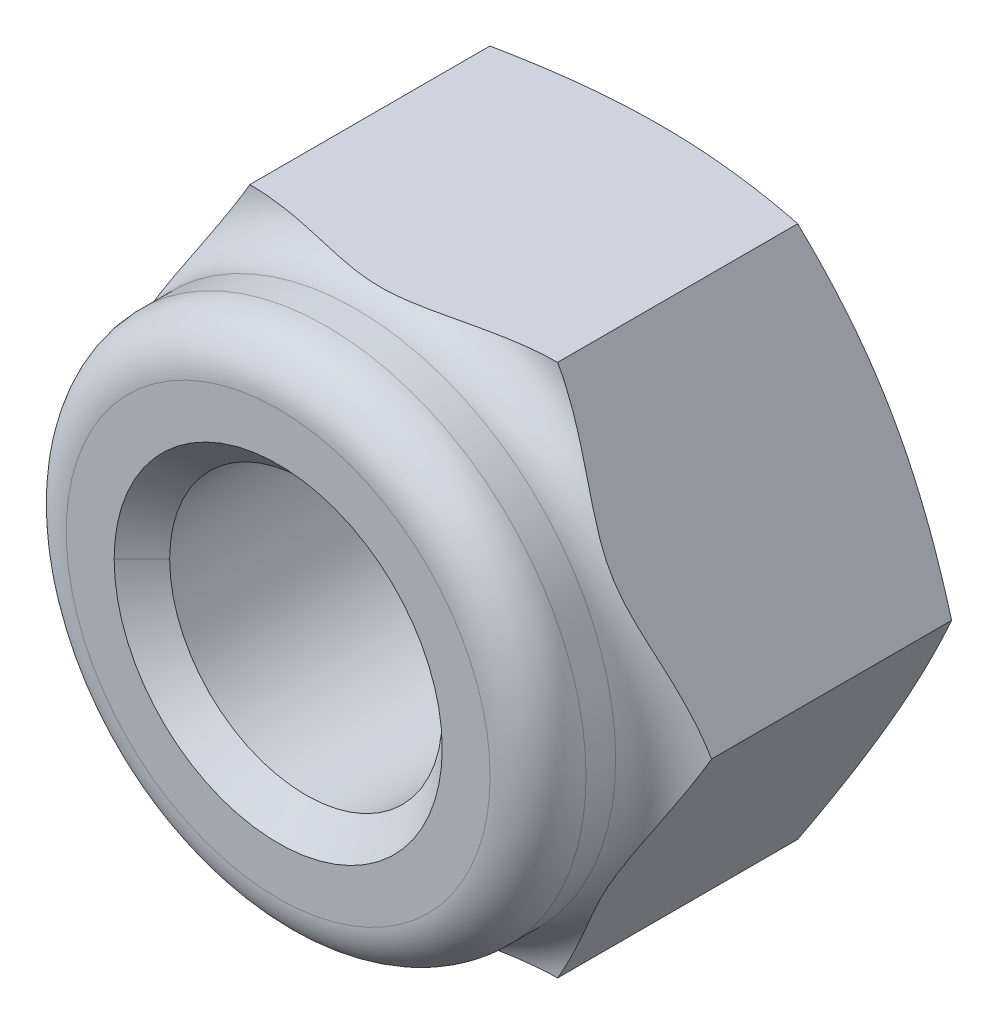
ISO-10303-21;
HEADER;
FILE_DESCRIPTION(('STEP AP214'),'2;1');
FILE_NAME('part.step','',(''),(''),'','','');
FILE_SCHEMA(('AUTOMOTIVE_DESIGN { 1 0 10303 214 1 1 1 1 }'));
ENDSEC;
DATA;
#1=APPLICATION_CONTEXT('core data for automotive mechanical design processes');
#2=APPLICATION_PROTOCOL_DEFINITION('international standard','automotive_design',2000,#1);
#3=PRODUCT_CONTEXT('',#1,'mechanical');
#4=PRODUCT('Part','Part','',(#3));
#5=PRODUCT_RELATED_PRODUCT_CATEGORY('part','',(#4));
#6=PRODUCT_DEFINITION_FORMATION('','',#4);
#7=PRODUCT_DEFINITION_CONTEXT('part definition',#1,'design');
#8=PRODUCT_DEFINITION('design','',#6,#7);
#9=PRODUCT_DEFINITION_SHAPE('','',#8);
#10=(LENGTH_UNIT() NAMED_UNIT(*) SI_UNIT(.MILLI.,.METRE.));
#11=(NAMED_UNIT(*) PLANE_ANGLE_UNIT() SI_UNIT($,.RADIAN.));
#12=(NAMED_UNIT(*) SI_UNIT($,.STERADIAN.) SOLID_ANGLE_UNIT());
#13=UNCERTAINTY_MEASURE_WITH_UNIT(LENGTH_MEASURE(1.E-05),#10,'distance_accuracy_value','');
#14=(GEOMETRIC_REPRESENTATION_CONTEXT(3) GLOBAL_UNCERTAINTY_ASSIGNED_CONTEXT((#13)) GLOBAL_UNIT_ASSIGNED_CONTEXT((#10,
#11,#12)) REPRESENTATION_CONTEXT('',''));
#15=CARTESIAN_POINT('',(0.,0.,0.));
#16=DIRECTION('',(0.,0.,1.));
#17=DIRECTION('',(1.,0.,0.));
#18=AXIS2_PLACEMENT_3D('',#15,#16,#17);
#19=CARTESIAN_POINT('',(0.,0.,7.60851666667));
#20=DIRECTION('',(0.,0.,1.));
#21=DIRECTION('',(0.,-1.,0.));
#22=AXIS2_PLACEMENT_3D('',#19,#20,#21);
#23=TOROIDAL_SURFACE('',#22,7.50555,1.16851666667);
#24=CARTESIAN_POINT('',(0.,0.,7.60851666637));
#25=DIRECTION('',(0.,0.,1.));
#26=DIRECTION('',(0.,-1.,0.));
#27=AXIS2_PLACEMENT_3D('',#24,#25,#26);
#28=CIRCLE('',#27,6.33703333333);
#29=CARTESIAN_POINT('',(0.,-6.33703333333,7.60851666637));
#30=VERTEX_POINT('',#29);
#31=EDGE_CURVE('E110',#30,#30,#28,.T.);
#32=ORIENTED_EDGE('',*,*,#31,.F.);
#33=EDGE_LOOP('',(#32));
#34=FACE_BOUND('',#33,.T.);
#35=CARTESIAN_POINT('',(-3.75277496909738,-6.4999970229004,6.44));
#36=CARTESIAN_POINT('',(-3.79393598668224,-6.42870404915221,6.44001193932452));
#37=CARTESIAN_POINT('',(-3.83508282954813,-6.35743562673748,6.44217394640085));
#38=CARTESIAN_POINT('',(-3.91726140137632,-6.2150981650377,6.45024483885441));
#39=CARTESIAN_POINT('',(-3.9582931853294,-6.14402903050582,6.45615143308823));
#40=CARTESIAN_POINT('',(-4.03989187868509,-6.00269594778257,6.47110217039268));
#41=CARTESIAN_POINT('',(-4.08045994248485,-5.93243000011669,6.48012195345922));
#42=CARTESIAN_POINT('',(-4.16142932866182,-5.79218690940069,6.50083579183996));
#43=CARTESIAN_POINT('',(-4.20183062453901,-5.72220981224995,6.51253025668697));
#44=CARTESIAN_POINT('',(-4.28310833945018,-5.58143268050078,6.53835268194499));
#45=CARTESIAN_POINT('',(-4.323981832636,-5.51063771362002,6.55251704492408));
#46=CARTESIAN_POINT('',(-4.40555622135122,-5.36934672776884,6.58269127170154));
#47=CARTESIAN_POINT('',(-4.44625711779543,-5.29885070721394,6.59870112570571));
#48=CARTESIAN_POINT('',(-4.52773992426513,-5.15771834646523,6.63220706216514));
#49=CARTESIAN_POINT('',(-4.56852102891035,-5.08708340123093,6.64971090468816));
#50=CARTESIAN_POINT('',(-4.6499756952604,-4.94599978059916,6.68563755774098));
#51=CARTESIAN_POINT('',(-4.69064926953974,-4.87555108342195,6.70406025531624));
#52=CARTESIAN_POINT('',(-4.80576543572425,-4.67616403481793,6.75681800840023));
#53=CARTESIAN_POINT('',(-4.88015153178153,-4.54732353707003,6.79164077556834));
#54=CARTESIAN_POINT('',(-4.99198727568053,-4.35361834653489,6.84193335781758));
#55=CARTESIAN_POINT('',(-5.02932386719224,-4.28894947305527,6.8583802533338));
#56=CARTESIAN_POINT('',(-5.10413438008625,-4.15937386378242,6.88996338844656));
#57=CARTESIAN_POINT('',(-5.1416083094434,-4.09446711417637,6.90509955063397));
#58=CARTESIAN_POINT('',(-5.25348797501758,-3.90068584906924,6.94709852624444));
#59=CARTESIAN_POINT('',(-5.32820938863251,-3.77126456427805,6.97097197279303));
#60=CARTESIAN_POINT('',(-5.44083114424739,-3.57619796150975,6.99586199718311));
#61=CARTESIAN_POINT('',(-5.47842354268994,-3.5110860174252,7.00233760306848));
#62=CARTESIAN_POINT('',(-5.55373146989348,-3.38064886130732,7.01105157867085));
#63=CARTESIAN_POINT('',(-5.59144698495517,-3.31532367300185,7.01329040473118));
#64=CARTESIAN_POINT('',(-5.66687801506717,-3.18467329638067,7.0132904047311));
#65=CARTESIAN_POINT('',(-5.70459353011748,-3.11934810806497,7.01105157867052));
#66=CARTESIAN_POINT('',(-5.77990145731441,-2.98891095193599,7.00233760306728));
#67=CARTESIAN_POINT('',(-5.81749385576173,-2.92379900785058,6.99586199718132));
#68=CARTESIAN_POINT('',(-5.9301156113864,-2.72873240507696,6.97097197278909));
#69=CARTESIAN_POINT('',(-6.00483702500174,-2.59931112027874,6.9470985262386));
#70=CARTESIAN_POINT('',(-6.11671669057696,-2.40552985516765,6.9050995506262));
#71=CARTESIAN_POINT('',(-6.15419061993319,-2.34062310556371,6.88996338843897));
#72=CARTESIAN_POINT('',(-6.22900113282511,-2.21104749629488,6.85838025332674));
#73=CARTESIAN_POINT('',(-6.26633772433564,-2.14637862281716,6.84193335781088));
#74=CARTESIAN_POINT('',(-6.37817346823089,-1.95267343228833,6.79164077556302));
#75=CARTESIAN_POINT('',(-6.45255956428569,-1.82383293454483,6.75681800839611));
#76=CARTESIAN_POINT('',(-6.56767573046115,-1.62444588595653,6.70406025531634));
#77=CARTESIAN_POINT('',(-6.60834930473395,-1.55399718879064,6.68563755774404));
#78=CARTESIAN_POINT('',(-6.68980397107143,-1.41291356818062,6.64971090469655));
#79=CARTESIAN_POINT('',(-6.73058507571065,-1.34227862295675,6.6322070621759));
#80=CARTESIAN_POINT('',(-6.81206788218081,-1.20114626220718,6.59870112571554));
#81=CARTESIAN_POINT('',(-6.85276877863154,-1.13065024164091,6.58269127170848));
#82=CARTESIAN_POINT('',(-6.93434316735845,-0.989359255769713,6.55251704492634));
#83=CARTESIAN_POINT('',(-6.97521666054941,-0.918564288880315,6.53835268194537));
#84=CARTESIAN_POINT('',(-7.05649436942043,-0.777787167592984,6.51253025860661));
#85=CARTESIAN_POINT('',(-7.0968956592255,-0.707810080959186,6.50083579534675));
#86=CARTESIAN_POINT('',(-7.17786503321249,-0.56756701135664,6.48012195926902));
#87=CARTESIAN_POINT('',(-7.21843309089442,-0.497301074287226,6.47110217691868));
#88=CARTESIAN_POINT('',(-7.30003177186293,-0.355968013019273,6.45615143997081));
#89=CARTESIAN_POINT('',(-7.34106354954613,-0.284898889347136,6.45024484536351));
#90=CARTESIAN_POINT('',(-7.42324210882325,-0.142561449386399,6.44217395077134));
#91=CARTESIAN_POINT('',(-7.46438894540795,-0.071293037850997,6.44001194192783));
#92=CARTESIAN_POINT('',(-7.5055499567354,-7.49409925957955E-08,6.44));
#93=B_SPLINE_CURVE_WITH_KNOTS('',3,(#35,#36,#37,#38,#39,#40,#41,#42,#43,#44,#45,#46,#47,#48,#49,
#50,#51,#52,#53,#54,#55,#56,#57,#58,#59,#60,#61,#62,#63,#64,#65,#66,#67,#68,#69,#70,#71,#72,#73,
#74,#75,#76,#77,#78,#79,#80,#81,#82,#83,#84,#85,#86,#87,#88,#89,#90,#91,#92),.UNSPECIFIED.,.F.,
.F.,(4,2,2,2,2,2,2,2,2,2,2,2,2,2,2,2,2,2,2,2,2,2,2,2,2,2,2,2,4),(0.,0.246897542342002,
0.493644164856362,0.738502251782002,0.983397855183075,1.23226661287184,1.48113404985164,
1.73138358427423,1.98160243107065,2.43998191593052,2.66935838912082,2.89874839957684,
3.35223187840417,3.5785183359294,3.8047804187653,4.03104250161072,4.25732895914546,
4.7108124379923,4.94020244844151,5.16957892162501,5.62795840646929,5.8781772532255,
6.1284267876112,6.37729422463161,6.62616298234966,6.87105854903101,7.11591659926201,
7.36266318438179,7.60956068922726),.UNSPECIFIED.);
#94=CARTESIAN_POINT('',(-3.75277494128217,-6.4999969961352,6.44));
#95=VERTEX_POINT('',#94);
#96=CARTESIAN_POINT('',(-7.50554999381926,-6.42311392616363E-08,6.44));
#97=VERTEX_POINT('',#96);
#98=EDGE_CURVE('E97',#95,#97,#93,.T.);
#99=ORIENTED_EDGE('',*,*,#98,.F.);
#100=CARTESIAN_POINT('',(3.75277506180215,-6.49999696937,6.44));
#101=CARTESIAN_POINT('',(3.6704530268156,-6.49999696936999,6.44001193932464));
#102=CARTESIAN_POINT('',(3.58815934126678,-6.49999696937,6.44217394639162));
#103=CARTESIAN_POINT('',(3.4238021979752,-6.49999696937,6.45024483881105));
#104=CARTESIAN_POINT('',(3.34173863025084,-6.49999696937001,6.4561514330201));
#105=CARTESIAN_POINT('',(3.17854124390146,-6.49999696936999,6.47110217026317));
#106=CARTESIAN_POINT('',(3.09740511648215,-6.49999696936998,6.48012195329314));
#107=CARTESIAN_POINT('',(2.93546634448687,-6.49999696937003,6.50083579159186));
#108=CARTESIAN_POINT('',(2.85466375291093,-6.49999696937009,6.51253025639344));
#109=CARTESIAN_POINT('',(2.69210831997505,-6.4999969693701,6.53835268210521));
#110=CARTESIAN_POINT('',(2.61036133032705,-6.49999696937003,6.55251704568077));
#111=CARTESIAN_POINT('',(2.44721254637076,-6.49999696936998,6.58269127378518));
#112=CARTESIAN_POINT('',(2.36581075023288,-6.49999696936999,6.59870112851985));
#113=CARTESIAN_POINT('',(2.2028451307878,-6.49999696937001,6.63220706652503));
#114=CARTESIAN_POINT('',(2.12128291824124,-6.49999696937,6.64971090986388));
#115=CARTESIAN_POINT('',(1.95837357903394,-6.49999696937,6.68563756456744));
#116=CARTESIAN_POINT('',(1.87702642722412,-6.49999696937,6.70406026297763));
#117=CARTESIAN_POINT('',(1.64679409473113,-6.49999696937,6.75681801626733));
#118=CARTESIAN_POINT('',(1.49802190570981,-6.49999696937,6.79164078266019));
#119=CARTESIAN_POINT('',(1.27435042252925,-6.49999696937,6.8419333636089));
#120=CARTESIAN_POINT('',(1.19967724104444,-6.49999696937,6.85838025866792));
#121=CARTESIAN_POINT('',(1.05005621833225,-6.49999696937,6.88996339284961));
#122=CARTESIAN_POINT('',(0.975108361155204,-6.49999696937,6.90509955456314));
#123=CARTESIAN_POINT('',(0.751349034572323,-6.49999696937,6.94709852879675));
#124=CARTESIAN_POINT('',(0.601906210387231,-6.49999696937,6.97097197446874));
#125=CARTESIAN_POINT('',(0.376662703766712,-6.49999696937,6.99586199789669));
#126=CARTESIAN_POINT('',(0.30147790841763,-6.49999696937,7.00233760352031));
#127=CARTESIAN_POINT('',(0.150862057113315,-6.49999696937,7.01105157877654));
#128=CARTESIAN_POINT('',(0.075431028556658,-6.49999696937,7.01329040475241));
#129=CARTESIAN_POINT('',(-0.0754310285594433,-6.49999696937,7.01329040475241));
#130=CARTESIAN_POINT('',(-0.150862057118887,-6.49999696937,7.01105157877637));
#131=CARTESIAN_POINT('',(-0.301477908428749,-6.49999696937,7.0023376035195));
#132=CARTESIAN_POINT('',(-0.376662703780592,-6.49999696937,6.99586199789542));
#133=CARTESIAN_POINT('',(-0.601906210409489,-6.49999696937,6.97097197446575));
#134=CARTESIAN_POINT('',(-0.751349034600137,-6.49999696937,6.94709852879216));
#135=CARTESIAN_POINT('',(-0.975108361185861,-6.49999696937,6.90509955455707));
#136=CARTESIAN_POINT('',(-1.05005621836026,-6.49999696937,6.88996339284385));
#137=CARTESIAN_POINT('',(-1.19967724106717,-6.49999696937,6.85838025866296));
#138=CARTESIAN_POINT('',(-1.27435042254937,-6.49999696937,6.84193336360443));
#139=CARTESIAN_POINT('',(-1.49802190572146,-6.49999696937,6.79164078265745));
#140=CARTESIAN_POINT('',(-1.64679409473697,-6.49999696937,6.75681801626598));
#141=CARTESIAN_POINT('',(-1.87702642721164,-6.49999696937,6.70406026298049));
#142=CARTESIAN_POINT('',(-1.95837357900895,-6.49999696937,6.6856375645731));
#143=CARTESIAN_POINT('',(-2.1212829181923,-6.49999696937,6.64971090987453));
#144=CARTESIAN_POINT('',(-2.20284513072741,-6.49999696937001,6.63220706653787));
#145=CARTESIAN_POINT('',(-2.36581075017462,-6.49999696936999,6.5987011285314));
#146=CARTESIAN_POINT('',(-2.44721254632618,-6.49999696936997,6.58269127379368));
#147=CARTESIAN_POINT('',(-2.61036133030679,-6.49999696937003,6.55251704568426));
#148=CARTESIAN_POINT('',(-2.69210831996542,-6.4999969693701,6.53835268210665));
#149=CARTESIAN_POINT('',(-2.85466374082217,-6.4999969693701,6.51253025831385));
#150=CARTESIAN_POINT('',(-2.93546632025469,-6.49999696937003,6.50083579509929));
#151=CARTESIAN_POINT('',(-3.09740506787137,-6.49999696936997,6.48012195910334));
#152=CARTESIAN_POINT('',(-3.17854118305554,-6.49999696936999,6.47110217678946));
#153=CARTESIAN_POINT('',(-3.34173854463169,-6.49999696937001,6.4561514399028));
#154=CARTESIAN_POINT('',(-3.42380209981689,-6.49999696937,6.45024484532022));
#155=CARTESIAN_POINT('',(-3.5881592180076,-6.49999696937,6.4421739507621));
#156=CARTESIAN_POINT('',(-3.67045289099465,-6.49999696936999,6.44001194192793));
#157=CARTESIAN_POINT('',(-3.75277491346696,-6.49999696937,6.44));
#158=B_SPLINE_CURVE_WITH_KNOTS('',3,(#100,#101,#102,#103,#104,#105,#106,#107,#108,#109,#110,
#111,#112,#113,#114,#115,#116,#117,#118,#119,#120,#121,#122,#123,#124,#125,#126,#127,#128,#129,
#130,#131,#132,#133,#134,#135,#136,#137,#138,#139,#140,#141,#142,#143,#144,#145,#146,#147,#148,
#149,#150,#151,#152,#153,#154,#155,#156,#157),.UNSPECIFIED.,.F.,.F.,(4,2,2,2,2,2,2,2,2,2,2,2,2,
2,2,2,2,2,2,2,2,2,2,2,2,2,2,2,4),(0.,0.24689754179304,0.493644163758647,0.738502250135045,
0.983397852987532,1.2322666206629,1.48113406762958,1.73138361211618,1.98160246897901,
2.43998194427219,2.66935841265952,2.89874841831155,3.35223188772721,3.57851834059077,
3.80478041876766,4.0310424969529,4.25732894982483,4.71081241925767,4.94020242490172,
5.16957889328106,5.6279583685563,5.87817722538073,6.12842676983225,6.37729421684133,
6.62616298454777,6.87105855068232,7.11591660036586,7.3626631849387,7.60956068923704),.UNSPECIFIED.);
#159=CARTESIAN_POINT('',(3.75277505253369,-6.4999969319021,6.44));
#160=VERTEX_POINT('',#159);
#161=EDGE_CURVE('E91',#160,#95,#158,.T.);
#162=ORIENTED_EDGE('',*,*,#161,.F.);
#163=CARTESIAN_POINT('',(7.50555003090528,5.35250158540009E-08,6.44));
#164=CARTESIAN_POINT('',(7.46438901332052,-0.0712929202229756,6.44001193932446));
#165=CARTESIAN_POINT('',(7.42324217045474,-0.142561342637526,6.44217394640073));
#166=CARTESIAN_POINT('',(7.34106359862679,-0.284898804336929,6.45024483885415));
#167=CARTESIAN_POINT('',(7.30003181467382,-0.35596793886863,6.4561514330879));
#168=CARTESIAN_POINT('',(7.21843312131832,-0.497301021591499,6.47110217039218));
#169=CARTESIAN_POINT('',(7.17786505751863,-0.567566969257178,6.48012195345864));
#170=CARTESIAN_POINT('',(7.09689567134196,-0.70781005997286,6.50083579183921));
#171=CARTESIAN_POINT('',(7.056494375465,-0.777787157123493,6.51253025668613));
#172=CARTESIAN_POINT('',(6.97521666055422,-0.918564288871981,6.53835268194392));
#173=CARTESIAN_POINT('',(6.93434316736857,-0.98935925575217,6.55251704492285));
#174=CARTESIAN_POINT('',(6.85276877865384,-1.1306502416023,6.58269127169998));
#175=CARTESIAN_POINT('',(6.81206788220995,-1.20114626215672,6.59870112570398));
#176=CARTESIAN_POINT('',(6.73058507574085,-1.34227862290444,6.63220706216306));
#177=CARTESIAN_POINT('',(6.68980397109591,-1.41291356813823,6.64971090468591));
#178=CARTESIAN_POINT('',(6.60834930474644,-1.553997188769,6.68563755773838));
#179=CARTESIAN_POINT('',(6.56767573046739,-1.62444588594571,6.70406025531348));
#180=CARTESIAN_POINT('',(6.45255956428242,-1.8238329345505,6.75681800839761));
#181=CARTESIAN_POINT('',(6.37817346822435,-1.95267343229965,6.79164077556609));
#182=CARTESIAN_POINT('',(6.26633772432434,-2.14637862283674,6.8419333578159));
#183=CARTESIAN_POINT('',(6.22900113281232,-2.21104749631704,6.85838025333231));
#184=CARTESIAN_POINT('',(6.1541906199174,-2.34062310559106,6.88996338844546));
#185=CARTESIAN_POINT('',(6.11671669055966,-2.40552985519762,6.90509955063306));
#186=CARTESIAN_POINT('',(6.00483702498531,-2.59931112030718,6.94709852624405));
#187=CARTESIAN_POINT('',(5.9301156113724,-2.72873240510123,6.97097197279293));
#188=CARTESIAN_POINT('',(5.81749385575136,-2.92379900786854,6.99586199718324));
#189=CARTESIAN_POINT('',(5.77990145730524,-2.98891095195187,7.00233760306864));
#190=CARTESIAN_POINT('',(5.70459353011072,-3.11934810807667,7.011051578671));
#191=CARTESIAN_POINT('',(5.66687801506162,-3.18467329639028,7.01329040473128));
#192=CARTESIAN_POINT('',(5.59144698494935,-3.31532367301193,7.01329040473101));
#193=CARTESIAN_POINT('',(5.55373146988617,-3.38064886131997,7.01105157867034));
#194=CARTESIAN_POINT('',(5.47842354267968,-3.51108601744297,7.00233760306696));
#195=CARTESIAN_POINT('',(5.44083114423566,-3.57619796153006,6.99586199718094));
#196=CARTESIAN_POINT('',(5.32820938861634,-3.77126456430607,6.97097197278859));
#197=CARTESIAN_POINT('',(5.25348797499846,-3.90068584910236,6.94709852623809));
#198=CARTESIAN_POINT('',(5.14160830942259,-4.0944671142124,6.90509955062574));
#199=CARTESIAN_POINT('',(5.10413438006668,-4.15937386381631,6.88996338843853));
#200=CARTESIAN_POINT('',(5.02932386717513,-4.2889494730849,6.85838025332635));
#201=CARTESIAN_POINT('',(4.99198727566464,-4.35361834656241,6.84193335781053));
#202=CARTESIAN_POINT('',(4.8801515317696,-4.54732353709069,6.79164077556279));
#203=CARTESIAN_POINT('',(4.80576543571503,-4.67616403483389,6.75681800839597));
#204=CARTESIAN_POINT('',(4.69064926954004,-4.87555108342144,6.7040602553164));
#205=CARTESIAN_POINT('',(4.64997569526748,-4.94599978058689,6.68563755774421));
#206=CARTESIAN_POINT('',(4.5685210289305,-5.08708340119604,6.64971090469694));
#207=CARTESIAN_POINT('',(4.52773992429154,-5.15771834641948,6.63220706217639));
#208=CARTESIAN_POINT('',(4.44625711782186,-5.29885070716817,6.5987011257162));
#209=CARTESIAN_POINT('',(4.40555622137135,-5.36934672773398,6.58269127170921));
#210=CARTESIAN_POINT('',(4.32398183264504,-5.51063771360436,6.55251704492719));
#211=CARTESIAN_POINT('',(4.28310833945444,-5.58143268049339,6.53835268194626));
#212=CARTESIAN_POINT('',(4.20183063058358,-5.72220980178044,6.51253025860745));
#213=CARTESIAN_POINT('',(4.1614293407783,-5.79218688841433,6.5008357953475));
#214=CARTESIAN_POINT('',(4.08045996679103,-5.93242995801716,6.4801219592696));
#215=CARTESIAN_POINT('',(4.03989190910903,-6.00269589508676,6.47110217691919));
#216=CARTESIAN_POINT('',(3.95829322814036,-6.14402895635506,6.45615143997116));
#217=CARTESIAN_POINT('',(3.91726145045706,-6.21509808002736,6.45024484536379));
#218=CARTESIAN_POINT('',(3.83508289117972,-6.35743551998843,6.44217395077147));
#219=CARTESIAN_POINT('',(3.79393605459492,-6.42870393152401,6.44001194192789));
#220=CARTESIAN_POINT('',(3.75277504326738,-6.49999689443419,6.44));
#221=B_SPLINE_CURVE_WITH_KNOTS('',3,(#163,#164,#165,#166,#167,#168,#169,#170,#171,#172,#173,
#174,#175,#176,#177,#178,#179,#180,#181,#182,#183,#184,#185,#186,#187,#188,#189,#190,#191,#192,
#193,#194,#195,#196,#197,#198,#199,#200,#201,#202,#203,#204,#205,#206,#207,#208,#209,#210,#211,
#212,#213,#214,#215,#216,#217,#218,#219,#220),.UNSPECIFIED.,.F.,.F.,(4,2,2,2,2,2,2,2,2,2,2,2,2,
2,2,2,2,2,2,2,2,2,2,2,2,2,2,2,4),(0.,0.246897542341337,0.493644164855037,0.738502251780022,
0.983397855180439,1.2322666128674,1.48113404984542,1.73138358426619,1.98160243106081,
2.43998191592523,2.66935838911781,2.8987483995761,3.3522318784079,3.57851833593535,
3.80478041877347,4.0310425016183,4.25732895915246,4.71081243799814,4.94020244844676,
5.16957892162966,5.62795840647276,5.87817725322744,6.1284267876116,6.3772942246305,
6.62616298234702,6.87105854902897,7.11591659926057,7.36266318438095,7.60956068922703),.UNSPECIFIED.);
#222=CARTESIAN_POINT('',(7.50554998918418,7.22630631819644E-08,6.44));
#223=VERTEX_POINT('',#222);
#224=EDGE_CURVE('E94',#223,#160,#221,.T.);
#225=ORIENTED_EDGE('',*,*,#224,.F.);
#226=CARTESIAN_POINT('',(3.75277496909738,6.4999970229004,6.44));
#227=CARTESIAN_POINT('',(3.79393598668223,6.42870404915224,6.44001193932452));
#228=CARTESIAN_POINT('',(3.83508282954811,6.35743562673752,6.44217394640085));
#229=CARTESIAN_POINT('',(3.91726140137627,6.21509816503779,6.4502448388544));
#230=CARTESIAN_POINT('',(3.95829318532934,6.14402903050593,6.45615143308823));
#231=CARTESIAN_POINT('',(4.03989187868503,6.00269594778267,6.47110217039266));
#232=CARTESIAN_POINT('',(4.0804599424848,5.93243000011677,6.48012195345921));
#233=CARTESIAN_POINT('',(4.16142932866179,5.79218690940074,6.50083579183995));
#234=CARTESIAN_POINT('',(4.20183062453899,5.72220981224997,6.51253025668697));
#235=CARTESIAN_POINT('',(4.28310833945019,5.58143268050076,6.538352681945));
#236=CARTESIAN_POINT('',(4.32398183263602,5.51063771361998,6.55251704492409));
#237=CARTESIAN_POINT('',(4.40555622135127,5.36934672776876,6.58269127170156));
#238=CARTESIAN_POINT('',(4.44625711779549,5.29885070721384,6.59870112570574));
#239=CARTESIAN_POINT('',(4.52773992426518,5.15771834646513,6.63220706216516));
#240=CARTESIAN_POINT('',(4.5685210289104,5.08708340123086,6.64971090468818));
#241=CARTESIAN_POINT('',(4.64997569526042,4.94599978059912,6.68563755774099));
#242=CARTESIAN_POINT('',(4.69064926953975,4.87555108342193,6.70406025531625));
#243=CARTESIAN_POINT('',(4.80576543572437,4.67616403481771,6.75681800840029));
#244=CARTESIAN_POINT('',(4.88015153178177,4.5473235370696,6.79164077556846));
#245=CARTESIAN_POINT('',(4.99198727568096,4.35361834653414,6.84193335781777));
#246=CARTESIAN_POINT('',(5.02932386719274,4.28894947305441,6.85838025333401));
#247=CARTESIAN_POINT('',(5.10413438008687,4.15937386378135,6.88996338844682));
#248=CARTESIAN_POINT('',(5.14160830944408,4.09446711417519,6.90509955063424));
#249=CARTESIAN_POINT('',(5.25348797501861,3.90068584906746,6.9470985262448));
#250=CARTESIAN_POINT('',(5.32820938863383,3.77126456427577,6.97097197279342));
#251=CARTESIAN_POINT('',(5.44083114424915,3.5761979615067,6.99586199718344));
#252=CARTESIAN_POINT('',(5.47842354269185,3.5110860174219,7.00233760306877));
#253=CARTESIAN_POINT('',(5.55373146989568,3.38064886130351,7.01105157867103));
#254=CARTESIAN_POINT('',(5.59144698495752,3.31532367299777,7.01329040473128));
#255=CARTESIAN_POINT('',(5.66687801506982,3.18467329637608,7.01329040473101));
#256=CARTESIAN_POINT('',(5.70459353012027,3.11934810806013,7.01105157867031));
#257=CARTESIAN_POINT('',(5.77990145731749,2.98891095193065,7.00233760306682));
#258=CARTESIAN_POINT('',(5.81749385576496,2.923799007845,6.99586199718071));
#259=CARTESIAN_POINT('',(5.93011561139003,2.72873240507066,6.97097197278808));
#260=CARTESIAN_POINT('',(6.00483702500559,2.59931112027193,6.94709852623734));
#261=CARTESIAN_POINT('',(6.11671669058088,2.40552985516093,6.90509955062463));
#262=CARTESIAN_POINT('',(6.15419061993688,2.34062310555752,6.88996338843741));
#263=CARTESIAN_POINT('',(6.22900113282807,2.21104749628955,6.85838025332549));
#264=CARTESIAN_POINT('',(6.26633772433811,2.14637862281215,6.84193335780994));
#265=CARTESIAN_POINT('',(6.37817346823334,1.95267343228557,6.79164077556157));
#266=CARTESIAN_POINT('',(6.45255956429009,1.82383293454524,6.75681800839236));
#267=CARTESIAN_POINT('',(6.5676757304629,1.62444588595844,6.70406025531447));
#268=CARTESIAN_POINT('',(6.60834930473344,1.55399718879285,6.68563755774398));
#269=CARTESIAN_POINT('',(6.68980397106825,1.4129135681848,6.64971090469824));
#270=CARTESIAN_POINT('',(6.73058507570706,1.34227862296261,6.63220706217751));
#271=CARTESIAN_POINT('',(6.81206788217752,1.20114626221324,6.59870112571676));
#272=CARTESIAN_POINT('',(6.85276877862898,1.13065024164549,6.58269127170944));
#273=CARTESIAN_POINT('',(6.93434316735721,0.989359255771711,6.55251704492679));
#274=CARTESIAN_POINT('',(6.97521666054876,0.918564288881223,6.53835268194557));
#275=CARTESIAN_POINT('',(7.05649436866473,0.777787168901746,6.51253025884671));
#276=CARTESIAN_POINT('',(7.09689565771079,0.707810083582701,6.50083579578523));
#277=CARTESIAN_POINT('',(7.17786503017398,0.567567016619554,6.48012195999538));
#278=CARTESIAN_POINT('',(7.21843308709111,0.49730108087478,6.47110217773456));
#279=CARTESIAN_POINT('',(7.30003176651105,0.35596802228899,6.45615144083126));
#280=CARTESIAN_POINT('',(7.34106354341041,0.28489889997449,6.45024484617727));
#281=CARTESIAN_POINT('',(7.42324210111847,0.142561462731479,6.44217395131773));
#282=CARTESIAN_POINT('',(7.46438893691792,0.0712930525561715,6.44001194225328));
#283=CARTESIAN_POINT('',(7.50554994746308,9.10011102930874E-08,6.44));
#284=B_SPLINE_CURVE_WITH_KNOTS('',3,(#226,#227,#228,#229,#230,#231,#232,#233,#234,#235,#236,
#237,#238,#239,#240,#241,#242,#243,#244,#245,#246,#247,#248,#249,#250,#251,#252,#253,#254,#255,
#256,#257,#258,#259,#260,#261,#262,#263,#264,#265,#266,#267,#268,#269,#270,#271,#272,#273,#274,
#275,#276,#277,#278,#279,#280,#281,#282,#283),.UNSPECIFIED.,.F.,.F.,(4,2,2,2,2,2,2,2,2,2,2,2,2,
2,2,2,2,2,2,2,2,2,2,2,2,2,2,2,4),(0.,0.246897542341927,0.493644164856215,0.73850225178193,
0.983397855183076,1.23226661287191,1.48113404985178,1.7313835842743,1.98160243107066,
2.43998191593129,2.66935838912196,2.89874839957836,3.3522318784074,3.57851833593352,
3.8047804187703,4.0310425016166,4.25732895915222,4.71081243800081,4.94020244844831,
5.16957892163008,5.6279584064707,5.87817725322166,6.12842678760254,6.377294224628,
6.62616298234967,6.87105854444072,7.11591659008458,7.36266317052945,7.60956067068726),.UNSPECIFIED.);
#285=CARTESIAN_POINT('',(3.75277494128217,6.4999969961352,6.44));
#286=VERTEX_POINT('',#285);
#287=EDGE_CURVE('E141',#286,#223,#284,.T.);
#288=ORIENTED_EDGE('',*,*,#287,.F.);
#289=CARTESIAN_POINT('',(-3.75277506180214,6.49999696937,6.44));
#290=CARTESIAN_POINT('',(-3.6704530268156,6.49999696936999,6.44001193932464));
#291=CARTESIAN_POINT('',(-3.58815934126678,6.49999696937,6.44217394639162));
#292=CARTESIAN_POINT('',(-3.4238021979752,6.49999696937,6.45024483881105));
#293=CARTESIAN_POINT('',(-3.34173863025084,6.49999696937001,6.4561514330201));
#294=CARTESIAN_POINT('',(-3.17854124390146,6.49999696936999,6.47110217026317));
#295=CARTESIAN_POINT('',(-3.09740511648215,6.49999696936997,6.48012195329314));
#296=CARTESIAN_POINT('',(-2.93546634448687,6.49999696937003,6.50083579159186));
#297=CARTESIAN_POINT('',(-2.85466375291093,6.49999696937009,6.51253025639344));
#298=CARTESIAN_POINT('',(-2.69210831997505,6.4999969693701,6.53835268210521));
#299=CARTESIAN_POINT('',(-2.61036133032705,6.49999696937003,6.55251704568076));
#300=CARTESIAN_POINT('',(-2.44721254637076,6.49999696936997,6.58269127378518));
#301=CARTESIAN_POINT('',(-2.36581075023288,6.49999696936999,6.59870112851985));
#302=CARTESIAN_POINT('',(-2.2028451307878,6.49999696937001,6.63220706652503));
#303=CARTESIAN_POINT('',(-2.12128291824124,6.49999696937,6.64971090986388));
#304=CARTESIAN_POINT('',(-1.95837357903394,6.49999696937,6.68563756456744));
#305=CARTESIAN_POINT('',(-1.87702642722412,6.49999696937,6.70406026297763));
#306=CARTESIAN_POINT('',(-1.64679409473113,6.49999696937,6.75681801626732));
#307=CARTESIAN_POINT('',(-1.49802190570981,6.49999696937,6.79164078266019));
#308=CARTESIAN_POINT('',(-1.27435042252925,6.49999696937,6.84193336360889));
#309=CARTESIAN_POINT('',(-1.19967724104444,6.49999696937,6.85838025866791));
#310=CARTESIAN_POINT('',(-1.05005621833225,6.49999696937,6.88996339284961));
#311=CARTESIAN_POINT('',(-0.975108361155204,6.49999696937,6.90509955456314));
#312=CARTESIAN_POINT('',(-0.751349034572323,6.49999696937,6.94709852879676));
#313=CARTESIAN_POINT('',(-0.601906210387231,6.49999696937,6.97097197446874));
#314=CARTESIAN_POINT('',(-0.376662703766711,6.49999696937,6.99586199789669));
#315=CARTESIAN_POINT('',(-0.301477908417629,6.49999696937,7.00233760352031));
#316=CARTESIAN_POINT('',(-0.150862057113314,6.49999696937,7.01105157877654));
#317=CARTESIAN_POINT('',(-0.075431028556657,6.49999696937,7.01329040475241));
#318=CARTESIAN_POINT('',(0.0754310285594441,6.49999696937,7.01329040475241));
#319=CARTESIAN_POINT('',(0.150862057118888,6.49999696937,7.01105157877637));
#320=CARTESIAN_POINT('',(0.301477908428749,6.49999696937,7.00233760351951));
#321=CARTESIAN_POINT('',(0.376662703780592,6.49999696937,6.99586199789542));
#322=CARTESIAN_POINT('',(0.601906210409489,6.49999696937,6.97097197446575));
#323=CARTESIAN_POINT('',(0.751349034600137,6.49999696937,6.94709852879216));
#324=CARTESIAN_POINT('',(0.975108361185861,6.49999696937,6.90509955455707));
#325=CARTESIAN_POINT('',(1.05005621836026,6.49999696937,6.88996339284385));
#326=CARTESIAN_POINT('',(1.19967724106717,6.49999696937,6.85838025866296));
#327=CARTESIAN_POINT('',(1.27435042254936,6.49999696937,6.84193336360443));
#328=CARTESIAN_POINT('',(1.49802190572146,6.49999696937,6.79164078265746));
#329=CARTESIAN_POINT('',(1.64679409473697,6.49999696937,6.75681801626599));
#330=CARTESIAN_POINT('',(1.87702642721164,6.49999696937,6.70406026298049));
#331=CARTESIAN_POINT('',(1.95837357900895,6.49999696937,6.6856375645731));
#332=CARTESIAN_POINT('',(2.1212829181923,6.49999696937,6.64971090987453));
#333=CARTESIAN_POINT('',(2.20284513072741,6.49999696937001,6.63220706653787));
#334=CARTESIAN_POINT('',(2.36581075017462,6.49999696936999,6.5987011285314));
#335=CARTESIAN_POINT('',(2.44721254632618,6.49999696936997,6.58269127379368));
#336=CARTESIAN_POINT('',(2.61036133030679,6.49999696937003,6.55251704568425));
#337=CARTESIAN_POINT('',(2.69210831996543,6.4999969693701,6.53835268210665));
#338=CARTESIAN_POINT('',(2.85466374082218,6.4999969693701,6.51253025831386));
#339=CARTESIAN_POINT('',(2.9354663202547,6.49999696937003,6.50083579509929));
#340=CARTESIAN_POINT('',(3.09740506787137,6.49999696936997,6.48012195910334));
#341=CARTESIAN_POINT('',(3.17854118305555,6.49999696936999,6.47110217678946));
#342=CARTESIAN_POINT('',(3.34173854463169,6.49999696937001,6.4561514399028));
#343=CARTESIAN_POINT('',(3.42380209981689,6.49999696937,6.45024484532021));
#344=CARTESIAN_POINT('',(3.5881592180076,6.49999696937,6.4421739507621));
#345=CARTESIAN_POINT('',(3.67045289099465,6.49999696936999,6.44001194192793));
#346=CARTESIAN_POINT('',(3.75277491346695,6.49999696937,6.44));
#347=B_SPLINE_CURVE_WITH_KNOTS('',3,(#289,#290,#291,#292,#293,#294,#295,#296,#297,#298,#299,
#300,#301,#302,#303,#304,#305,#306,#307,#308,#309,#310,#311,#312,#313,#314,#315,#316,#317,#318,
#319,#320,#321,#322,#323,#324,#325,#326,#327,#328,#329,#330,#331,#332,#333,#334,#335,#336,#337,
#338,#339,#340,#341,#342,#343,#344,#345,#346),.UNSPECIFIED.,.F.,.F.,(4,2,2,2,2,2,2,2,2,2,2,2,2,
2,2,2,2,2,2,2,2,2,2,2,2,2,2,2,4),(0.,0.24689754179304,0.493644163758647,0.738502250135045,
0.983397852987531,1.2322666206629,1.48113406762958,1.73138361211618,1.98160246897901,
2.43998194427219,2.66935841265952,2.89874841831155,3.35223188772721,3.57851834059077,
3.80478041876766,4.0310424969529,4.25732894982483,4.71081241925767,4.94020242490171,
5.16957889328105,5.6279583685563,5.87817722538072,6.12842676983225,6.37729421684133,
6.62616298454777,6.87105855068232,7.11591660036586,7.3626631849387,7.60956068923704),.UNSPECIFIED.);
#348=CARTESIAN_POINT('',(-3.75277505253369,6.4999969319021,6.44));
#349=VERTEX_POINT('',#348);
#350=EDGE_CURVE('E149',#349,#286,#347,.T.);
#351=ORIENTED_EDGE('',*,*,#350,.F.);
#352=CARTESIAN_POINT('',(-7.5055500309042,-5.35231501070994E-08,6.44));
#353=CARTESIAN_POINT('',(-7.46438901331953,0.0712929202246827,6.4400119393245));
#354=CARTESIAN_POINT('',(-7.42324217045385,0.142561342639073,6.44217394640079));
#355=CARTESIAN_POINT('',(-7.34106359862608,0.284898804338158,6.45024483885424));
#356=CARTESIAN_POINT('',(-7.3000318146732,0.3559679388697,6.456151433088));
#357=CARTESIAN_POINT('',(-7.21843312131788,0.497301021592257,6.47110217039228));
#358=CARTESIAN_POINT('',(-7.17786505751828,0.567566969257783,6.48012195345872));
#359=CARTESIAN_POINT('',(-7.09689567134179,0.707810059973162,6.50083579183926));
#360=CARTESIAN_POINT('',(-7.05649437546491,0.777787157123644,6.51253025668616));
#361=CARTESIAN_POINT('',(-6.97521666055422,0.918564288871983,6.53835268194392));
#362=CARTESIAN_POINT('',(-6.93434316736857,0.989359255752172,6.55251704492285));
#363=CARTESIAN_POINT('',(-6.85276877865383,1.1306502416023,6.58269127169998));
#364=CARTESIAN_POINT('',(-6.81206788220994,1.20114626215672,6.59870112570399));
#365=CARTESIAN_POINT('',(-6.73058507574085,1.34227862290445,6.63220706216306));
#366=CARTESIAN_POINT('',(-6.6898039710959,1.41291356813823,6.64971090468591));
#367=CARTESIAN_POINT('',(-6.60834930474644,1.553997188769,6.68563755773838));
#368=CARTESIAN_POINT('',(-6.56767573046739,1.62444588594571,6.70406025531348));
#369=CARTESIAN_POINT('',(-6.45255956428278,1.82383293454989,6.75681800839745));
#370=CARTESIAN_POINT('',(-6.37817346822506,1.95267343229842,6.79164077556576));
#371=CARTESIAN_POINT('',(-6.26633772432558,2.14637862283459,6.84193335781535));
#372=CARTESIAN_POINT('',(-6.22900113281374,2.21104749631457,6.85838025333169));
#373=CARTESIAN_POINT('',(-6.15419061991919,2.34062310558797,6.88996338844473));
#374=CARTESIAN_POINT('',(-6.11671669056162,2.40552985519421,6.90509955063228));
#375=CARTESIAN_POINT('',(-6.00483702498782,2.59931112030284,6.9470985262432));
#376=CARTESIAN_POINT('',(-5.93011561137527,2.72873240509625,6.97097197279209));
#377=CARTESIAN_POINT('',(-5.81749385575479,2.92379900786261,6.99586199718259));
#378=CARTESIAN_POINT('',(-5.77990145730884,2.98891095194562,7.00233760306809));
#379=CARTESIAN_POINT('',(-5.70459353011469,3.11934810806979,7.01105157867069));
#380=CARTESIAN_POINT('',(-5.66687801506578,3.18467329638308,7.01329040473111));
#381=CARTESIAN_POINT('',(-5.5914469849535,3.31532367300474,7.01329040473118));
#382=CARTESIAN_POINT('',(-5.55373146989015,3.3806488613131,7.01105157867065));
#383=CARTESIAN_POINT('',(-5.47842354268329,3.51108601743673,7.00233760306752));
#384=CARTESIAN_POINT('',(-5.44083114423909,3.57619796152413,6.9958619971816));
#385=CARTESIAN_POINT('',(-5.32820938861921,3.77126456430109,6.97097197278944));
#386=CARTESIAN_POINT('',(-5.25348797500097,3.90068584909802,6.94709852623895));
#387=CARTESIAN_POINT('',(-5.14160830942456,4.09446711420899,6.90509955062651));
#388=CARTESIAN_POINT('',(-5.10413438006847,4.15937386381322,6.88996338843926));
#389=CARTESIAN_POINT('',(-5.02932386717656,4.28894947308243,6.85838025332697));
#390=CARTESIAN_POINT('',(-4.99198727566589,4.35361834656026,6.84193335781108));
#391=CARTESIAN_POINT('',(-4.88015153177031,4.54732353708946,6.79164077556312));
#392=CARTESIAN_POINT('',(-4.80576543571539,4.67616403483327,6.75681800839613));
#393=CARTESIAN_POINT('',(-4.69064926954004,4.87555108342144,6.7040602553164));
#394=CARTESIAN_POINT('',(-4.64997569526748,4.94599978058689,6.68563755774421));
#395=CARTESIAN_POINT('',(-4.5685210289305,5.08708340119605,6.64971090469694));
#396=CARTESIAN_POINT('',(-4.52773992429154,5.15771834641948,6.63220706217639));
#397=CARTESIAN_POINT('',(-4.44625711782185,5.29885070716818,6.59870112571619));
#398=CARTESIAN_POINT('',(-4.40555622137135,5.36934672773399,6.58269127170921));
#399=CARTESIAN_POINT('',(-4.32398183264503,5.51063771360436,6.55251704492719));
#400=CARTESIAN_POINT('',(-4.28310833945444,5.58143268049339,6.53835268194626));
#401=CARTESIAN_POINT('',(-4.20183063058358,5.72220980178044,6.51253025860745));
#402=CARTESIAN_POINT('',(-4.1614293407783,5.79218688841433,6.5008357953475));
#403=CARTESIAN_POINT('',(-4.08045996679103,5.93242995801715,6.4801219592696));
#404=CARTESIAN_POINT('',(-4.03989190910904,6.00269589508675,6.47110217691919));
#405=CARTESIAN_POINT('',(-3.95829322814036,6.14402895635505,6.45615143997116));
#406=CARTESIAN_POINT('',(-3.91726145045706,6.21509808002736,6.45024484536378));
#407=CARTESIAN_POINT('',(-3.83508289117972,6.35743551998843,6.44217395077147));
#408=CARTESIAN_POINT('',(-3.79393605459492,6.428703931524,6.44001194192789));
#409=CARTESIAN_POINT('',(-3.75277504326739,6.49999689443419,6.44));
#410=B_SPLINE_CURVE_WITH_KNOTS('',3,(#352,#353,#354,#355,#356,#357,#358,#359,#360,#361,#362,
#363,#364,#365,#366,#367,#368,#369,#370,#371,#372,#373,#374,#375,#376,#377,#378,#379,#380,#381,
#382,#383,#384,#385,#386,#387,#388,#389,#390,#391,#392,#393,#394,#395,#396,#397,#398,#399,#400,
#401,#402,#403,#404,#405,#406,#407,#408,#409),.UNSPECIFIED.,.F.,.F.,(4,2,2,2,2,2,2,2,2,2,2,2,2,
2,2,2,2,2,2,2,2,2,2,2,2,2,2,2,4),(0.,0.246897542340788,0.49364416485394,0.738502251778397,
0.983397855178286,1.23226661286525,1.48113404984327,1.73138358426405,1.98160243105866,
2.43998191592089,2.66935838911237,2.89874839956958,3.35223187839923,3.57851833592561,
3.80478041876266,4.03104250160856,4.25732895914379,4.71081243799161,4.94020244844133,
5.16957892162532,5.62795840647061,5.87817725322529,6.12842678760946,6.37729422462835,
6.62616298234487,6.87105854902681,7.11591659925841,7.36266318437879,7.60956068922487),.UNSPECIFIED.);
#411=EDGE_CURVE('E217',#97,#349,#410,.T.);
#412=ORIENTED_EDGE('',*,*,#411,.F.);
#413=EDGE_LOOP('',(#99,#162,#225,#288,#351,#412));
#414=FACE_BOUND('',#413,.T.);
#415=ADVANCED_FACE('F16',(#34,#414),#23,.F.);
#416=CARTESIAN_POINT('',(0.,0.,7.97));
#417=DIRECTION('',(0.,0.,1.));
#418=DIRECTION('',(0.,-1.,0.));
#419=AXIS2_PLACEMENT_3D('',#416,#417,#418);
#420=CYLINDRICAL_SURFACE('',#419,6.33703333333);
#421=ORIENTED_EDGE('',*,*,#31,.T.);
#422=EDGE_LOOP('',(#421));
#423=FACE_BOUND('',#422,.T.);
#424=CARTESIAN_POINT('',(0.,0.,8.33148333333));
#425=DIRECTION('',(0.,0.,1.));
#426=DIRECTION('',(0.,-1.,0.));
#427=AXIS2_PLACEMENT_3D('',#424,#425,#426);
#428=CIRCLE('',#427,6.33703333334);
#429=CARTESIAN_POINT('',(0.,-6.33703333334,8.33148333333));
#430=VERTEX_POINT('',#429);
#431=EDGE_CURVE('E119',#430,#430,#428,.T.);
#432=ORIENTED_EDGE('',*,*,#431,.F.);
#433=EDGE_LOOP('',(#432));
#434=FACE_BOUND('',#433,.T.);
#435=ADVANCED_FACE('F132',(#423,#434),#420,.T.);
#436=CARTESIAN_POINT('',(5.6291625,-3.24999848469,0.));
#437=DIRECTION('',(0.866025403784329,-0.50000000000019,0.));
#438=DIRECTION('',(0.50000000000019,0.866025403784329,0.));
#439=AXIS2_PLACEMENT_3D('',#436,#437,#438);
#440=PLANE('',#439);
#441=CARTESIAN_POINT('',(7.50554999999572,-4.02246779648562E-12,0.585454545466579));
#442=CARTESIAN_POINT('',(7.3744381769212,-0.227092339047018,0.532478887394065));
#443=CARTESIAN_POINT('',(7.24289360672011,-0.454934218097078,0.483494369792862));
#444=CARTESIAN_POINT('',(6.9789346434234,-0.912124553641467,0.395013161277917));
#445=CARTESIAN_POINT('',(6.84651978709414,-1.14147381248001,0.355522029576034));
#446=CARTESIAN_POINT('',(6.58100872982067,-1.60135245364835,0.287608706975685));
#447=CARTESIAN_POINT('',(6.44791274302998,-1.83188146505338,0.259183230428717));
#448=CARTESIAN_POINT('',(6.1812263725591,-2.29379580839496,0.214718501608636));
#449=CARTESIAN_POINT('',(6.04763610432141,-2.52518094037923,0.198676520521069));
#450=CARTESIAN_POINT('',(5.78248928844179,-2.98442869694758,0.17997636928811));
#451=CARTESIAN_POINT('',(5.65093672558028,-3.2122844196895,0.177095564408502));
#452=CARTESIAN_POINT('',(5.38790934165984,-3.66786121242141,0.18426729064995));
#453=CARTESIAN_POINT('',(5.25643452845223,-3.89558226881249,0.194320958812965));
#454=CARTESIAN_POINT('',(4.99395974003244,-4.35020193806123,0.226821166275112));
#455=CARTESIAN_POINT('',(4.8629595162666,-4.57710098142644,0.249259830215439));
#456=CARTESIAN_POINT('',(4.6015845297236,-5.02981573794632,0.305442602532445));
#457=CARTESIAN_POINT('',(4.47120970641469,-5.25563155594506,0.339185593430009));
#458=CARTESIAN_POINT('',(4.29203839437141,-5.56596537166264,0.392523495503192));
#459=CARTESIAN_POINT('',(4.24291545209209,-5.65104880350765,0.407872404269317));
#460=CARTESIAN_POINT('',(4.1447855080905,-5.82101485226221,0.439906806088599));
#461=CARTESIAN_POINT('',(4.09577849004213,-5.90589749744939,0.456592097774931));
#462=CARTESIAN_POINT('',(3.99770857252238,-6.0757595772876,0.491281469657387));
#463=CARTESIAN_POINT('',(3.94864605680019,-6.16073834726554,0.509289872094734));
#464=CARTESIAN_POINT('',(3.85062852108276,-6.33050969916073,0.546498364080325));
#465=CARTESIAN_POINT('',(3.80167351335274,-6.41530225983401,0.565698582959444));
#466=CARTESIAN_POINT('',(3.75277504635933,-6.49999688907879,0.585454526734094));
#467=B_SPLINE_CURVE_WITH_KNOTS('',3,(#441,#442,#443,#444,#445,#446,#447,#448,#449,#450,#451,
#452,#453,#454,#455,#456,#457,#458,#459,#460,#461,#462,#463,#464,#465,#466),.UNSPECIFIED.,.F.,
.F.,(4,2,2,2,2,2,2,2,2,2,2,2,4),(0.,0.802620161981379,1.60570918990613,2.40855957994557,
3.21123300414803,4.00027685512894,4.78939007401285,5.57800208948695,6.36653617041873,
6.66484343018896,6.96310582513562,7.26239004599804,7.56170680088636),.UNSPECIFIED.);
#468=CARTESIAN_POINT('',(7.50554996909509,5.35278574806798E-08,0.585454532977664));
#469=VERTEX_POINT('',#468);
#470=CARTESIAN_POINT('',(3.75277502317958,-6.49999692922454,0.585454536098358));
#471=VERTEX_POINT('',#470);
#472=EDGE_CURVE('E122',#469,#471,#467,.T.);
#473=ORIENTED_EDGE('',*,*,#472,.F.);
#474=DIRECTION('',(0.,0.,1.));
#475=VECTOR('',#474,1.);
#476=CARTESIAN_POINT('',(7.50554993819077,1.07061225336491E-07,0.));
#477=LINE('',#476,#475);
#478=EDGE_CURVE('E109',#223,#469,#477,.F.);
#479=ORIENTED_EDGE('',*,*,#478,.F.);
#480=ORIENTED_EDGE('',*,*,#224,.T.);
#481=DIRECTION('',(0.,0.,1.));
#482=VECTOR('',#481,1.);
#483=CARTESIAN_POINT('',(3.752775,-6.49999696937,0.));
#484=LINE('',#483,#482);
#485=EDGE_CURVE('E102',#471,#160,#484,.T.);
#486=ORIENTED_EDGE('',*,*,#485,.F.);
#487=EDGE_LOOP('',(#473,#479,#480,#486));
#488=FACE_BOUND('',#487,.T.);
#489=ADVANCED_FACE('F107',(#488),#440,.T.);
#490=CARTESIAN_POINT('',(0.,-6.49999696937,0.));
#491=DIRECTION('',(0.,-1.,0.));
#492=DIRECTION('',(1.,0.,0.));
#493=AXIS2_PLACEMENT_3D('',#490,#491,#492);
#494=PLANE('',#493);
#495=ORIENTED_EDGE('',*,*,#485,.T.);
#496=ORIENTED_EDGE('',*,*,#161,.T.);
#497=DIRECTION('',(0.,0.,1.));
#498=VECTOR('',#497,1.);
#499=CARTESIAN_POINT('',(-3.75277500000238,-6.49999696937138,0.));
#500=LINE('',#499,#498);
#501=CARTESIAN_POINT('',(-3.75277495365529,-6.49999696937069,0.585454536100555));
#502=VERTEX_POINT('',#501);
#503=EDGE_CURVE('E117',#502,#95,#500,.T.);
#504=ORIENTED_EDGE('',*,*,#503,.F.);
#505=CARTESIAN_POINT('',(3.75277503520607,-6.4999969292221,0.585454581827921));
#506=CARTESIAN_POINT('',(3.4905513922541,-6.49999695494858,0.532478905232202));
#507=CARTESIAN_POINT('',(3.22746225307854,-6.4999969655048,0.483494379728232));
#508=CARTESIAN_POINT('',(2.69954432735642,-6.49999697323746,0.395013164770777));
#509=CARTESIAN_POINT('',(2.43471461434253,-6.49999697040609,0.35552203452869));
#510=CARTESIAN_POINT('',(1.90369249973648,-6.49999696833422,0.287608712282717));
#511=CARTESIAN_POINT('',(1.6375005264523,-6.49999696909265,0.259183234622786));
#512=CARTESIAN_POINT('',(1.10412778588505,-6.49999696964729,0.21471850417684));
#513=CARTESIAN_POINT('',(0.836947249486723,-6.49999696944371,0.198676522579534));
#514=CARTESIAN_POINT('',(0.306653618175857,-6.49999696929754,0.179976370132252));
#515=CARTESIAN_POINT('',(0.0435484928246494,-6.49999696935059,0.177095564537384));
#516=CARTESIAN_POINT('',(-0.482506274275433,-6.49999696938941,0.184267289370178));
#517=CARTESIAN_POINT('',(-0.745455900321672,-6.49999696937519,0.194320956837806));
#518=CARTESIAN_POINT('',(-1.27040547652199,-6.49999696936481,0.226821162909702));
#519=CARTESIAN_POINT('',(-1.53240592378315,-6.49999696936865,0.249259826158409));
#520=CARTESIAN_POINT('',(-2.05515589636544,-6.49999696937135,0.30544259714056));
#521=CARTESIAN_POINT('',(-2.31590554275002,-6.4999969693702,0.33918558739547));
#522=CARTESIAN_POINT('',(-2.67424817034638,-6.49999696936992,0.39252348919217));
#523=CARTESIAN_POINT('',(-2.77249405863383,-6.49999696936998,0.407872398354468));
#524=CARTESIAN_POINT('',(-2.96875395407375,-6.49999696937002,0.439906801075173));
#525=CARTESIAN_POINT('',(-3.06676799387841,-6.49999696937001,0.456592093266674));
#526=CARTESIAN_POINT('',(-3.26290783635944,-6.49999696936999,0.491281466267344));
#527=CARTESIAN_POINT('',(-3.36103287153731,-6.49999696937,0.509289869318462));
#528=CARTESIAN_POINT('',(-3.55706795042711,-6.49999696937,0.54649836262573));
#529=CARTESIAN_POINT('',(-3.65497796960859,-6.49999696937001,0.565698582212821));
#530=CARTESIAN_POINT('',(-3.75277490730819,-6.49999696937,0.585454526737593));
#531=B_SPLINE_CURVE_WITH_KNOTS('',3,(#505,#506,#507,#508,#509,#510,#511,#512,#513,#514,#515,
#516,#517,#518,#519,#520,#521,#522,#523,#524,#525,#526,#527,#528,#529,#530),.UNSPECIFIED.,.F.,
.F.,(4,2,2,2,2,2,2,2,2,2,2,2,4),(0.,0.802620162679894,1.60570919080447,2.40855958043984,
3.21123300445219,4.00027685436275,4.78939007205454,5.57800208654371,6.36653616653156,
6.66484343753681,6.96310584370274,7.26239007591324,7.56170684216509),.UNSPECIFIED.);
#532=EDGE_CURVE('E113',#471,#502,#531,.T.);
#533=ORIENTED_EDGE('',*,*,#532,.F.);
#534=EDGE_LOOP('',(#495,#496,#504,#533));
#535=FACE_BOUND('',#534,.T.);
#536=ADVANCED_FACE('F112',(#535),#494,.T.);
#537=CARTESIAN_POINT('',(-5.6291625,-3.24999848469,0.));
#538=DIRECTION('',(-0.866025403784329,-0.50000000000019,0.));
#539=DIRECTION('',(0.50000000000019,-0.866025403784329,0.));
#540=AXIS2_PLACEMENT_3D('',#537,#538,#539);
#541=PLANE('',#540);
#542=CARTESIAN_POINT('',(-3.75277494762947,-6.49999697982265,0.585454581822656));
#543=CARTESIAN_POINT('',(-3.88388679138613,-6.27290465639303,0.532478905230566));
#544=CARTESIAN_POINT('',(-4.01543137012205,-6.04506278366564,0.483494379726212));
#545=CARTESIAN_POINT('',(-4.2793903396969,-5.58787245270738,0.395013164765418));
#546=CARTESIAN_POINT('',(-4.41180519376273,-5.35852319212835,0.355522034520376));
#547=CARTESIAN_POINT('',(-4.67731624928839,-4.89864454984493,0.287608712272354));
#548=CARTESIAN_POINT('',(-4.81041223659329,-4.66811553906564,0.259183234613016));
#549=CARTESIAN_POINT('',(-5.07709860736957,-4.206201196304,0.214718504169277));
#550=CARTESIAN_POINT('',(-5.21068887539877,-3.97481606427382,0.198676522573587));
#551=CARTESIAN_POINT('',(-5.47583569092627,-3.51556830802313,0.179976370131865));
#552=CARTESIAN_POINT('',(-5.6073882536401,-3.28771258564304,0.177095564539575));
#553=CARTESIAN_POINT('',(-5.87041563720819,-2.83213579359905,0.184267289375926));
#554=CARTESIAN_POINT('',(-6.00189045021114,-2.60441473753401,0.194320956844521));
#555=CARTESIAN_POINT('',(-6.26436523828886,-2.14979506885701,0.226821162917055));
#556=CARTESIAN_POINT('',(-6.39536546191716,-1.9228960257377,0.249259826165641));
#557=CARTESIAN_POINT('',(-6.65674044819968,-1.47018126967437,0.305442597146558));
#558=CARTESIAN_POINT('',(-6.78711527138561,-1.24436545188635,0.339185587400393));
#559=CARTESIAN_POINT('',(-6.96628658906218,-0.934031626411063,0.39252349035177));
#560=CARTESIAN_POINT('',(-7.01540953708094,-0.84894818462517,0.407872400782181));
#561=CARTESIAN_POINT('',(-7.11353949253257,-0.678982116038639,0.43990680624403));
#562=CARTESIAN_POINT('',(-7.16254651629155,-0.594099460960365,0.456592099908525));
#563=CARTESIAN_POINT('',(-7.26061644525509,-0.424237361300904,0.491281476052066));
#564=CARTESIAN_POINT('',(-7.30967896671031,-0.33925858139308,0.509289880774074));
#565=CARTESIAN_POINT('',(-7.40769651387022,-0.169487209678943,0.546498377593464));
#566=CARTESIAN_POINT('',(-7.45665152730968,-0.0846946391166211,0.565698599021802));
#567=CARTESIAN_POINT('',(-7.50554999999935,-5.63230455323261E-12,0.585454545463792));
#568=B_SPLINE_CURVE_WITH_KNOTS('',3,(#542,#543,#544,#545,#546,#547,#548,#549,#550,#551,#552,
#553,#554,#555,#556,#557,#558,#559,#560,#561,#562,#563,#564,#565,#566,#567),.UNSPECIFIED.,.F.,
.F.,(4,2,2,2,2,2,2,2,2,2,2,2,4),(0.,0.802620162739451,1.60570919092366,2.40855958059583,
3.21123300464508,4.00027685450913,4.78939007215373,5.57800208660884,6.3665361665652,
6.66484346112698,6.96310589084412,7.26239014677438,7.56170693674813),.UNSPECIFIED.);
#569=CARTESIAN_POINT('',(-7.50555000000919,-2.75234844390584E-12,0.585454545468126));
#570=VERTEX_POINT('',#569);
#571=EDGE_CURVE('E204',#502,#570,#568,.T.);
#572=ORIENTED_EDGE('',*,*,#571,.F.);
#573=ORIENTED_EDGE('',*,*,#503,.T.);
#574=ORIENTED_EDGE('',*,*,#98,.T.);
#575=DIRECTION('',(0.,0.,1.));
#576=VECTOR('',#575,1.);
#577=CARTESIAN_POINT('',(-7.50555000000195,1.12496817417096E-12,0.));
#578=LINE('',#577,#576);
#579=EDGE_CURVE('E223',#570,#97,#578,.T.);
#580=ORIENTED_EDGE('',*,*,#579,.F.);
#581=EDGE_LOOP('',(#572,#573,#574,#580));
#582=FACE_BOUND('',#581,.T.);
#583=ADVANCED_FACE('F212',(#582),#541,.T.);
#584=CARTESIAN_POINT('',(-5.6291625,3.24999848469,0.));
#585=DIRECTION('',(-0.866025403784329,0.50000000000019,0.));
#586=DIRECTION('',(-0.50000000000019,-0.866025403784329,0.));
#587=AXIS2_PLACEMENT_3D('',#584,#585,#586);
#588=PLANE('',#587);
#589=CARTESIAN_POINT('',(-7.50554999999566,4.32887725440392E-12,0.58545454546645));
#590=CARTESIAN_POINT('',(-7.37443817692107,0.227092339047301,0.532478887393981));
#591=CARTESIAN_POINT('',(-7.24289360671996,0.454934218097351,0.4834943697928));
#592=CARTESIAN_POINT('',(-6.97893464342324,0.912124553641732,0.395013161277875));
#593=CARTESIAN_POINT('',(-6.84651978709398,1.14147381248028,0.355522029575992));
#594=CARTESIAN_POINT('',(-6.58100872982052,1.60135245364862,0.287608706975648));
#595=CARTESIAN_POINT('',(-6.44791274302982,1.83188146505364,0.259183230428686));
#596=CARTESIAN_POINT('',(-6.18122637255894,2.29379580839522,0.214718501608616));
#597=CARTESIAN_POINT('',(-6.04763610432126,2.52518094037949,0.198676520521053));
#598=CARTESIAN_POINT('',(-5.78248928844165,2.98442869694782,0.179976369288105));
#599=CARTESIAN_POINT('',(-5.65093672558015,3.21228441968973,0.177095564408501));
#600=CARTESIAN_POINT('',(-5.38790934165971,3.66786121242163,0.184267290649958));
#601=CARTESIAN_POINT('',(-5.25643452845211,3.8955822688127,0.194320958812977));
#602=CARTESIAN_POINT('',(-4.99395974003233,4.35020193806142,0.22682116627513));
#603=CARTESIAN_POINT('',(-4.8629595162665,4.57710098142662,0.249259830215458));
#604=CARTESIAN_POINT('',(-4.60158452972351,5.02981573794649,0.305442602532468));
#605=CARTESIAN_POINT('',(-4.47120970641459,5.25563155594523,0.339185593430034));
#606=CARTESIAN_POINT('',(-4.29203839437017,5.56596537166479,0.392523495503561));
#607=CARTESIAN_POINT('',(-4.24291545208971,5.65104880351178,0.407872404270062));
#608=CARTESIAN_POINT('',(-4.14478550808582,5.82101485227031,0.439906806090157));
#609=CARTESIAN_POINT('',(-4.09577849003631,5.90589749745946,0.456592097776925));
#610=CARTESIAN_POINT('',(-3.99770857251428,6.07575957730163,0.491281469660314));
#611=CARTESIAN_POINT('',(-3.94864605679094,6.16073834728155,0.509289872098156));
#612=CARTESIAN_POINT('',(-3.85062852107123,6.3305096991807,0.546498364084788));
#613=CARTESIAN_POINT('',(-3.80167351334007,6.41530225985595,0.565698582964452));
#614=CARTESIAN_POINT('',(-3.75277504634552,6.4999968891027,0.585454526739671));
#615=B_SPLINE_CURVE_WITH_KNOTS('',3,(#589,#590,#591,#592,#593,#594,#595,#596,#597,#598,#599,
#600,#601,#602,#603,#604,#605,#606,#607,#608,#609,#610,#611,#612,#613,#614),.UNSPECIFIED.,.F.,
.F.,(4,2,2,2,2,2,2,2,2,2,2,2,4),(0.,0.802620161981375,1.60570918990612,2.40855957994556,
3.21123300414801,4.00027685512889,4.78939007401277,5.57800208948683,6.36653617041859,
6.66484343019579,6.96310582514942,7.26239004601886,7.56170680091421),.UNSPECIFIED.);
#616=CARTESIAN_POINT('',(-3.75277502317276,6.49999692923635,0.585454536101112));
#617=VERTEX_POINT('',#616);
#618=EDGE_CURVE('E199',#570,#617,#615,.T.);
#619=ORIENTED_EDGE('',*,*,#618,.F.);
#620=ORIENTED_EDGE('',*,*,#579,.T.);
#621=ORIENTED_EDGE('',*,*,#411,.T.);
#622=DIRECTION('',(0.,0.,1.));
#623=VECTOR('',#622,1.);
#624=CARTESIAN_POINT('',(-3.752775,6.49999696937,0.));
#625=LINE('',#624,#623);
#626=EDGE_CURVE('E246',#617,#349,#625,.T.);
#627=ORIENTED_EDGE('',*,*,#626,.F.);
#628=EDGE_LOOP('',(#619,#620,#621,#627));
#629=FACE_BOUND('',#628,.T.);
#630=ADVANCED_FACE('F209',(#629),#588,.T.);
#631=CARTESIAN_POINT('',(0.,6.49999696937,0.));
#632=DIRECTION('',(0.,1.,0.));
#633=DIRECTION('',(0.,0.,1.));
#634=AXIS2_PLACEMENT_3D('',#631,#632,#633);
#635=PLANE('',#634);
#636=ORIENTED_EDGE('',*,*,#626,.T.);
#637=ORIENTED_EDGE('',*,*,#350,.T.);
#638=DIRECTION('',(0.,0.,1.));
#639=VECTOR('',#638,1.);
#640=CARTESIAN_POINT('',(3.75277500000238,6.49999696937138,0.));
#641=LINE('',#640,#639);
#642=CARTESIAN_POINT('',(3.75277495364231,6.49999696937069,0.585454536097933));
#643=VERTEX_POINT('',#642);
#644=EDGE_CURVE('E123',#643,#286,#641,.T.);
#645=ORIENTED_EDGE('',*,*,#644,.F.);
#646=CARTESIAN_POINT('',(-3.75277503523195,6.49999692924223,0.58545458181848));
#647=CARTESIAN_POINT('',(-3.49055139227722,6.49999695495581,0.532478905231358));
#648=CARTESIAN_POINT('',(-3.22746225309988,6.49999696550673,0.483494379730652));
#649=CARTESIAN_POINT('',(-2.69954432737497,6.49999697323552,0.395013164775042));
#650=CARTESIAN_POINT('',(-2.43471461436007,6.49999697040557,0.355522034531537));
#651=CARTESIAN_POINT('',(-1.90369249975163,6.49999696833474,0.287608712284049));
#652=CARTESIAN_POINT('',(-1.63750052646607,6.49999696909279,0.259183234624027));
#653=CARTESIAN_POINT('',(-1.10412778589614,6.49999696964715,0.21471850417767));
#654=CARTESIAN_POINT('',(-0.836947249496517,6.49999696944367,0.198676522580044));
#655=CARTESIAN_POINT('',(-0.306653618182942,6.49999696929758,0.179976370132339));
#656=CARTESIAN_POINT('',(-0.0435484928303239,6.4999969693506,0.177095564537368));
#657=CARTESIAN_POINT('',(0.482506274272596,6.4999969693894,0.184267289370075));
#658=CARTESIAN_POINT('',(0.745455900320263,6.49999696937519,0.19432095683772));
#659=CARTESIAN_POINT('',(1.27040547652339,6.49999696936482,0.226821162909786));
#660=CARTESIAN_POINT('',(1.53240592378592,6.49999696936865,0.249259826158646));
#661=CARTESIAN_POINT('',(2.05515589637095,6.49999696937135,0.305442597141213));
#662=CARTESIAN_POINT('',(2.31590554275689,6.4999969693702,0.339185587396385));
#663=CARTESIAN_POINT('',(2.67424817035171,6.49999696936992,0.392523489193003));
#664=CARTESIAN_POINT('',(2.77249405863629,6.49999696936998,0.40787239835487));
#665=CARTESIAN_POINT('',(2.96875395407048,6.49999696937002,0.439906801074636));
#666=CARTESIAN_POINT('',(3.06676799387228,6.49999696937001,0.456592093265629));
#667=CARTESIAN_POINT('',(3.26290783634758,6.49999696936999,0.491281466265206));
#668=CARTESIAN_POINT('',(3.36103287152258,6.49999696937,0.509289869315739));
#669=CARTESIAN_POINT('',(3.55706795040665,6.49999696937,0.546498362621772));
#670=CARTESIAN_POINT('',(3.65497796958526,6.49999696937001,0.565698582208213));
#671=CARTESIAN_POINT('',(3.75277490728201,6.49999696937,0.585454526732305));
#672=B_SPLINE_CURVE_WITH_KNOTS('',3,(#646,#647,#648,#649,#650,#651,#652,#653,#654,#655,#656,
#657,#658,#659,#660,#661,#662,#663,#664,#665,#666,#667,#668,#669,#670,#671),.UNSPECIFIED.,.F.,
.F.,(4,2,2,2,2,2,2,2,2,2,2,2,4),(0.,0.802620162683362,1.60570919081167,2.40855958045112,
3.21123300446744,4.00027685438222,4.78939007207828,5.57800208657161,6.36653616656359,
6.66484343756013,6.96310584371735,7.26239007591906,7.56170684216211),.UNSPECIFIED.);
#673=EDGE_CURVE('E181',#617,#643,#672,.T.);
#674=ORIENTED_EDGE('',*,*,#673,.F.);
#675=EDGE_LOOP('',(#636,#637,#645,#674));
#676=FACE_BOUND('',#675,.T.);
#677=ADVANCED_FACE('F164',(#676),#635,.T.);
#678=CARTESIAN_POINT('',(5.6291625,3.24999848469,0.));
#679=DIRECTION('',(0.866025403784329,0.50000000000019,0.));
#680=DIRECTION('',(-0.50000000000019,0.866025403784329,0.));
#681=AXIS2_PLACEMENT_3D('',#678,#679,#680);
#682=PLANE('',#681);
#683=CARTESIAN_POINT('',(3.75277494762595,6.49999697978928,0.585454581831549));
#684=CARTESIAN_POINT('',(3.88388679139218,6.27290465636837,0.532478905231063));
#685=CARTESIAN_POINT('',(4.0154313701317,6.04506278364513,0.483494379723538));
#686=CARTESIAN_POINT('',(4.27939033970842,5.58787245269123,0.395013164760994));
#687=CARTESIAN_POINT('',(4.41180519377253,5.35852319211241,0.355522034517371));
#688=CARTESIAN_POINT('',(4.67731624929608,4.8986445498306,0.287608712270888));
#689=CARTESIAN_POINT('',(4.8104122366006,4.66811553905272,0.259183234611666));
#690=CARTESIAN_POINT('',(5.07709860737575,4.20620119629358,0.214718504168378));
#691=CARTESIAN_POINT('',(5.21068887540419,3.9748160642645,0.198676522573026));
#692=CARTESIAN_POINT('',(5.47583569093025,3.51556830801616,0.179976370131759));
#693=CARTESIAN_POINT('',(5.60738825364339,3.28771258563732,0.177095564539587));
#694=CARTESIAN_POINT('',(5.87041563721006,2.83213579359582,0.184267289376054));
#695=CARTESIAN_POINT('',(6.00189045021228,2.60441473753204,0.194320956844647));
#696=CARTESIAN_POINT('',(6.26436523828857,2.1497950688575,0.226821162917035));
#697=CARTESIAN_POINT('',(6.39536546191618,1.92289602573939,0.249259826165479));
#698=CARTESIAN_POINT('',(6.65674044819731,1.47018126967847,0.305442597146));
#699=CARTESIAN_POINT('',(6.78711527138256,1.24436545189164,0.339185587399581));
#700=CARTESIAN_POINT('',(6.96628658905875,0.934031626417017,0.39252349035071));
#701=CARTESIAN_POINT('',(7.0154095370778,0.848948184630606,0.407872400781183));
#702=CARTESIAN_POINT('',(7.11353949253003,0.678982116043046,0.439906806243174));
#703=CARTESIAN_POINT('',(7.1625465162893,0.594099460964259,0.456592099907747));
#704=CARTESIAN_POINT('',(7.26061644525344,0.424237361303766,0.491281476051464));
#705=CARTESIAN_POINT('',(7.30967896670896,0.339258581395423,0.509289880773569));
#706=CARTESIAN_POINT('',(7.40769651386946,0.169487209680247,0.546498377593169));
#707=CARTESIAN_POINT('',(7.45665152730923,0.084694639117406,0.565698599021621));
#708=CARTESIAN_POINT('',(7.50554999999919,5.89992000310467E-12,0.585454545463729));
#709=B_SPLINE_CURVE_WITH_KNOTS('',3,(#683,#684,#685,#686,#687,#688,#689,#690,#691,#692,#693,
#694,#695,#696,#697,#698,#699,#700,#701,#702,#703,#704,#705,#706,#707,#708),.UNSPECIFIED.,.F.,
.F.,(4,2,2,2,2,2,2,2,2,2,2,2,4),(0.,0.80262016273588,1.60570919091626,2.40855958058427,
3.21123300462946,4.00027685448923,4.7893900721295,5.5780020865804,6.36653616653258,
6.66484346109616,6.96310589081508,7.26239014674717,7.56170693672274),.UNSPECIFIED.);
#710=EDGE_CURVE('E172',#643,#469,#709,.T.);
#711=ORIENTED_EDGE('',*,*,#710,.F.);
#712=ORIENTED_EDGE('',*,*,#644,.T.);
#713=ORIENTED_EDGE('',*,*,#287,.T.);
#714=ORIENTED_EDGE('',*,*,#478,.T.);
#715=EDGE_LOOP('',(#711,#712,#713,#714));
#716=FACE_BOUND('',#715,.T.);
#717=ADVANCED_FACE('F160',(#716),#682,.T.);
#718=CARTESIAN_POINT('',(0.,0.,8.33148333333));
#719=DIRECTION('',(0.,0.,1.));
#720=DIRECTION('',(0.,-1.,0.));
#721=AXIS2_PLACEMENT_3D('',#718,#719,#720);
#722=TOROIDAL_SURFACE('',#721,5.16851666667,1.16851666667);
#723=ORIENTED_EDGE('',*,*,#431,.T.);
#724=EDGE_LOOP('',(#723));
#725=FACE_BOUND('',#724,.T.);
#726=CARTESIAN_POINT('',(0.,0.,9.5));
#727=DIRECTION('',(0.,0.,-1.));
#728=DIRECTION('',(0.,1.,0.));
#729=AXIS2_PLACEMENT_3D('',#726,#727,#728);
#730=CIRCLE('',#729,5.16851666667);
#731=CARTESIAN_POINT('',(5.16851666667,0.,9.5));
#732=VERTEX_POINT('',#731);
#733=CARTESIAN_POINT('',(0.,5.16851666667,9.5));
#734=VERTEX_POINT('',#733);
#735=EDGE_CURVE('E180',#732,#734,#730,.F.);
#736=ORIENTED_EDGE('',*,*,#735,.F.);
#737=CARTESIAN_POINT('',(0.,0.,9.5));
#738=DIRECTION('',(0.,0.,-1.));
#739=DIRECTION('',(1.,0.,0.));
#740=AXIS2_PLACEMENT_3D('',#737,#738,#739);
#741=CIRCLE('',#740,5.16851666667);
#742=CARTESIAN_POINT('',(0.,-5.16851666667,9.5));
#743=VERTEX_POINT('',#742);
#744=EDGE_CURVE('E292',#743,#732,#741,.F.);
#745=ORIENTED_EDGE('',*,*,#744,.F.);
#746=CARTESIAN_POINT('',(0.,0.,9.5));
#747=DIRECTION('',(0.,0.,-1.));
#748=DIRECTION('',(0.,-1.,0.));
#749=AXIS2_PLACEMENT_3D('',#746,#747,#748);
#750=CIRCLE('',#749,5.16851666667);
#751=EDGE_CURVE('E295',#734,#743,#750,.F.);
#752=ORIENTED_EDGE('',*,*,#751,.F.);
#753=EDGE_LOOP('',(#736,#745,#752));
#754=FACE_BOUND('',#753,.T.);
#755=ADVANCED_FACE('F163',(#725,#754),#722,.T.);
#756=CARTESIAN_POINT('',(0.,0.,0.588967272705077));
#757=DIRECTION('',(0.,0.,1.));
#758=DIRECTION('',(0.,-1.,0.));
#759=AXIS2_PLACEMENT_3D('',#756,#757,#758);
#760=CONICAL_SURFACE('',#759,7.51424430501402,1.18682389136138);
#761=CARTESIAN_POINT('',(0.,0.,-5.45548849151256E-12));
#762=DIRECTION('',(0.,0.,1.));
#763=DIRECTION('',(0.,-1.,0.));
#764=AXIS2_PLACEMENT_3D('',#761,#762,#763);
#765=CIRCLE('',#764,6.05649915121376);
#766=CARTESIAN_POINT('',(0.,-6.05649915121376,-5.45513894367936E-12));
#767=VERTEX_POINT('',#766);
#768=EDGE_CURVE('E182',#767,#767,#765,.T.);
#769=ORIENTED_EDGE('',*,*,#768,.T.);
#770=EDGE_LOOP('',(#769));
#771=FACE_BOUND('',#770,.T.);
#772=ORIENTED_EDGE('',*,*,#673,.T.);
#773=ORIENTED_EDGE('',*,*,#710,.T.);
#774=ORIENTED_EDGE('',*,*,#472,.T.);
#775=ORIENTED_EDGE('',*,*,#532,.T.);
#776=ORIENTED_EDGE('',*,*,#571,.T.);
#777=ORIENTED_EDGE('',*,*,#618,.T.);
#778=EDGE_LOOP('',(#772,#773,#774,#775,#776,#777));
#779=FACE_BOUND('',#778,.T.);
#780=ADVANCED_FACE('F188',(#771,#779),#760,.T.);
#781=CARTESIAN_POINT('',(0.,0.,9.5));
#782=DIRECTION('',(0.,0.,1.));
#783=DIRECTION('',(1.,0.,0.));
#784=AXIS2_PLACEMENT_3D('',#781,#782,#783);
#785=PLANE('',#784);
#786=CARTESIAN_POINT('',(0.,0.,9.50000000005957));
#787=DIRECTION('',(0.,0.,1.));
#788=DIRECTION('',(1.,0.,0.));
#789=AXIS2_PLACEMENT_3D('',#786,#787,#788);
#790=CIRCLE('',#789,3.99999999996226);
#791=CARTESIAN_POINT('',(-3.99999999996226,0.,9.50000000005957));
#792=VERTEX_POINT('',#791);
#793=CARTESIAN_POINT('',(3.99999999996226,0.,9.50000000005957));
#794=VERTEX_POINT('',#793);
#795=EDGE_CURVE('E291',#792,#794,#790,.F.);
#796=ORIENTED_EDGE('',*,*,#795,.T.);
#797=CARTESIAN_POINT('',(0.,0.,9.50000000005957));
#798=DIRECTION('',(0.,0.,1.));
#799=DIRECTION('',(1.,0.,0.));
#800=AXIS2_PLACEMENT_3D('',#797,#798,#799);
#801=CIRCLE('',#800,3.99999999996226);
#802=EDGE_CURVE('E294',#794,#792,#801,.F.);
#803=ORIENTED_EDGE('',*,*,#802,.T.);
#804=EDGE_LOOP('',(#796,#803));
#805=FACE_BOUND('',#804,.T.);
#806=ORIENTED_EDGE('',*,*,#751,.T.);
#807=ORIENTED_EDGE('',*,*,#744,.T.);
#808=ORIENTED_EDGE('',*,*,#735,.T.);
#809=EDGE_LOOP('',(#806,#807,#808));
#810=FACE_BOUND('',#809,.T.);
#811=ADVANCED_FACE('F192',(#805,#810),#785,.T.);
#812=CARTESIAN_POINT('',(0.,0.,0.));
#813=DIRECTION('',(0.,0.,1.));
#814=DIRECTION('',(1.,0.,0.));
#815=AXIS2_PLACEMENT_3D('',#812,#813,#814);
#816=PLANE('',#815);
#817=CARTESIAN_POINT('',(0.,0.,0.));
#818=DIRECTION('',(0.,0.,-1.));
#819=DIRECTION('',(0.,1.,0.));
#820=AXIS2_PLACEMENT_3D('',#817,#818,#819);
#821=CIRCLE('',#820,3.99999999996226);
#822=CARTESIAN_POINT('',(0.,3.99999999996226,0.));
#823=VERTEX_POINT('',#822);
#824=EDGE_CURVE('E288',#823,#823,#821,.F.);
#825=ORIENTED_EDGE('',*,*,#824,.T.);
#826=EDGE_LOOP('',(#825));
#827=FACE_BOUND('',#826,.T.);
#828=ORIENTED_EDGE('',*,*,#768,.F.);
#829=EDGE_LOOP('',(#828));
#830=FACE_BOUND('',#829,.T.);
#831=ADVANCED_FACE('F277',(#827,#830),#816,.F.);
#832=CARTESIAN_POINT('',(0.,0.,9.49999999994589));
#833=DIRECTION('',(0.,0.,1.));
#834=DIRECTION('',(1.,0.,0.));
#835=AXIS2_PLACEMENT_3D('',#832,#833,#834);
#836=CONICAL_SURFACE('',#835,3.99999999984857,0.785398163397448);
#837=ORIENTED_EDGE('',*,*,#795,.F.);
#838=DIRECTION('',(0.707106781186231,0.,-0.707106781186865));
#839=VECTOR('',#838,1.);
#840=CARTESIAN_POINT('',(-498994.499999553,9.16631302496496E-11,499000.));
#841=LINE('',#840,#839);
#842=CARTESIAN_POINT('',(-3.32343750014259,0.,8.82343750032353));
#843=VERTEX_POINT('',#842);
#844=EDGE_CURVE('E324',#792,#843,#841,.T.);
#845=ORIENTED_EDGE('',*,*,#844,.T.);
#846=CARTESIAN_POINT('',(0.,0.,8.8234375));
#847=DIRECTION('',(0.,0.,1.));
#848=DIRECTION('',(0.,-1.,0.));
#849=AXIS2_PLACEMENT_3D('',#846,#847,#848);
#850=CIRCLE('',#849,3.3234375);
#851=CARTESIAN_POINT('',(3.32343750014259,0.,8.82343750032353));
#852=VERTEX_POINT('',#851);
#853=EDGE_CURVE('E37',#843,#852,#850,.F.);
#854=ORIENTED_EDGE('',*,*,#853,.T.);
#855=DIRECTION('',(-0.707106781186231,0.,-0.707106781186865));
#856=VECTOR('',#855,1.);
#857=CARTESIAN_POINT('',(498994.499999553,-9.16644749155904E-11,499000.));
#858=LINE('',#857,#856);
#859=EDGE_CURVE('E326',#852,#794,#858,.F.);
#860=ORIENTED_EDGE('',*,*,#859,.T.);
#861=EDGE_LOOP('',(#837,#845,#854,#860));
#862=FACE_BOUND('',#861,.T.);
#863=ADVANCED_FACE('F274',(#862),#836,.F.);
#864=CARTESIAN_POINT('',(0.,0.,9.49999999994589));
#865=DIRECTION('',(0.,0.,1.));
#866=DIRECTION('',(1.,0.,0.));
#867=AXIS2_PLACEMENT_3D('',#864,#865,#866);
#868=CONICAL_SURFACE('',#867,3.99999999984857,0.785398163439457);
#869=CARTESIAN_POINT('',(0.,0.,8.82343750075));
#870=DIRECTION('',(0.,0.,1.));
#871=DIRECTION('',(0.,-1.,0.));
#872=AXIS2_PLACEMENT_3D('',#869,#870,#871);
#873=CIRCLE('',#872,3.3234375);
#874=EDGE_CURVE('E29',#852,#843,#873,.F.);
#875=ORIENTED_EDGE('',*,*,#874,.T.);
#876=ORIENTED_EDGE('',*,*,#844,.F.);
#877=ORIENTED_EDGE('',*,*,#802,.F.);
#878=ORIENTED_EDGE('',*,*,#859,.F.);
#879=EDGE_LOOP('',(#875,#876,#877,#878));
#880=FACE_BOUND('',#879,.T.);
#881=ADVANCED_FACE('F267',(#880),#868,.F.);
#882=CARTESIAN_POINT('',(0.,0.,1.13686837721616E-10));
#883=DIRECTION('',(0.,0.,-1.));
#884=DIRECTION('',(0.,1.,0.));
#885=AXIS2_PLACEMENT_3D('',#882,#883,#884);
#886=CONICAL_SURFACE('',#885,3.99999999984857,0.785398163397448);
#887=ORIENTED_EDGE('',*,*,#824,.F.);
#888=EDGE_LOOP('',(#887));
#889=FACE_BOUND('',#888,.T.);
#890=CARTESIAN_POINT('',(0.,0.,0.6765625));
#891=DIRECTION('',(0.,0.,1.));
#892=DIRECTION('',(0.,-1.,0.));
#893=AXIS2_PLACEMENT_3D('',#890,#891,#892);
#894=CIRCLE('',#893,3.3234375);
#895=CARTESIAN_POINT('',(0.,-3.3234375,0.6765625));
#896=VERTEX_POINT('',#895);
#897=EDGE_CURVE('E11',#896,#896,#894,.T.);
#898=ORIENTED_EDGE('',*,*,#897,.T.);
#899=EDGE_LOOP('',(#898));
#900=FACE_BOUND('',#899,.T.);
#901=ADVANCED_FACE('F261',(#889,#900),#886,.F.);
#902=CARTESIAN_POINT('',(0.,0.,4.75));
#903=DIRECTION('',(0.,0.,1.));
#904=DIRECTION('',(0.,-1.,0.));
#905=AXIS2_PLACEMENT_3D('',#902,#903,#904);
#906=CYLINDRICAL_SURFACE('',#905,3.3234375);
#907=ORIENTED_EDGE('',*,*,#897,.F.);
#908=EDGE_LOOP('',(#907));
#909=FACE_BOUND('',#908,.T.);
#910=ORIENTED_EDGE('',*,*,#853,.F.);
#911=ORIENTED_EDGE('',*,*,#874,.F.);
#912=EDGE_LOOP('',(#910,#911));
#913=FACE_BOUND('',#912,.T.);
#914=ADVANCED_FACE('F259',(#909,#913),#906,.F.);
#915=CLOSED_SHELL('',(#415,#435,#489,#536,#583,#630,#677,#717,#755,#780,#811,#831,#863,#881,
#901,#914));
#916=MANIFOLD_SOLID_BREP('B1',#915);
#917=ADVANCED_BREP_SHAPE_REPRESENTATION('',(#18,#916),#14);
#918=SHAPE_DEFINITION_REPRESENTATION(#9,#917);
ENDSEC;
END-ISO-10303-21;
